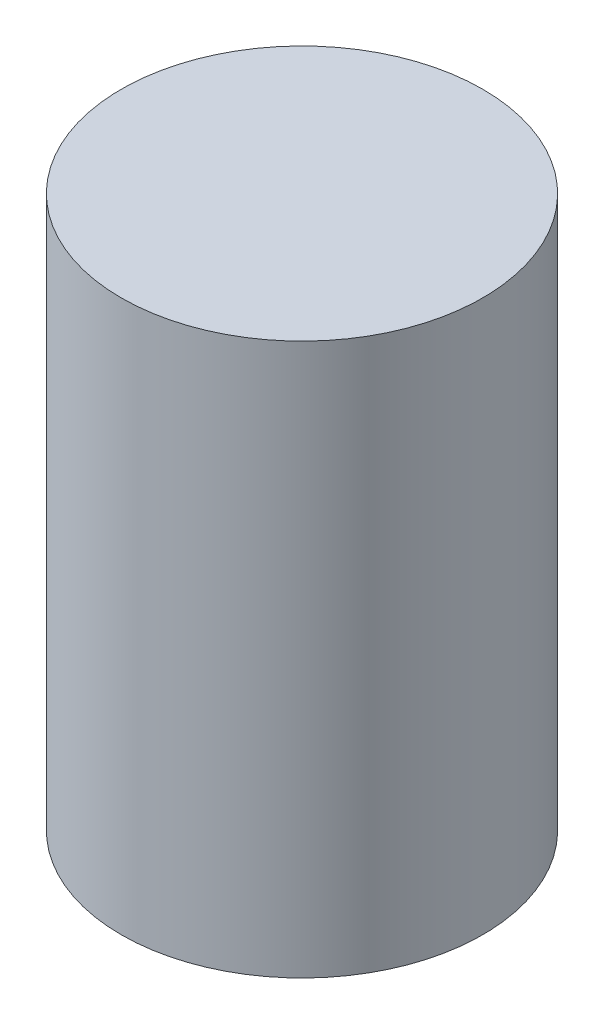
ISO-10303-21;
HEADER;
FILE_DESCRIPTION(('STEP AP214'),'2;1');
FILE_NAME('part.step','',(''),(''),'','','');
FILE_SCHEMA(('AUTOMOTIVE_DESIGN { 1 0 10303 214 1 1 1 1 }'));
ENDSEC;
DATA;
#1=APPLICATION_CONTEXT('core data for automotive mechanical design processes');
#2=APPLICATION_PROTOCOL_DEFINITION('international standard','automotive_design',2000,#1);
#3=PRODUCT_CONTEXT('',#1,'mechanical');
#4=PRODUCT('Part','Part','',(#3));
#5=PRODUCT_RELATED_PRODUCT_CATEGORY('part','',(#4));
#6=PRODUCT_DEFINITION_FORMATION('','',#4);
#7=PRODUCT_DEFINITION_CONTEXT('part definition',#1,'design');
#8=PRODUCT_DEFINITION('design','',#6,#7);
#9=PRODUCT_DEFINITION_SHAPE('','',#8);
#10=(LENGTH_UNIT() NAMED_UNIT(*) SI_UNIT(.MILLI.,.METRE.));
#11=(NAMED_UNIT(*) PLANE_ANGLE_UNIT() SI_UNIT($,.RADIAN.));
#12=(NAMED_UNIT(*) SI_UNIT($,.STERADIAN.) SOLID_ANGLE_UNIT());
#13=UNCERTAINTY_MEASURE_WITH_UNIT(LENGTH_MEASURE(1.E-05),#10,'distance_accuracy_value','');
#14=(GEOMETRIC_REPRESENTATION_CONTEXT(3) GLOBAL_UNCERTAINTY_ASSIGNED_CONTEXT((#13)) GLOBAL_UNIT_ASSIGNED_CONTEXT((#10,
#11,#12)) REPRESENTATION_CONTEXT('',''));
#15=CARTESIAN_POINT('',(0.,0.,0.));
#16=DIRECTION('',(0.,0.,1.));
#17=DIRECTION('',(1.,0.,0.));
#18=AXIS2_PLACEMENT_3D('',#15,#16,#17);
#19=CARTESIAN_POINT('',(0.,67.818,0.));
#20=DIRECTION('',(0.,-1.,0.));
#21=DIRECTION('',(0.,0.,-1.));
#22=AXIS2_PLACEMENT_3D('',#19,#20,#21);
#23=CYLINDRICAL_SURFACE('',#22,22.225);
#24=CARTESIAN_POINT('',(0.,67.818,0.));
#25=DIRECTION('',(0.,1.,0.));
#26=DIRECTION('',(0.,0.,1.));
#27=AXIS2_PLACEMENT_3D('',#24,#25,#26);
#28=CIRCLE('',#27,22.225);
#29=CARTESIAN_POINT('',(0.,67.818,22.225));
#30=VERTEX_POINT('',#29);
#31=EDGE_CURVE('E10',#30,#30,#28,.T.);
#32=ORIENTED_EDGE('',*,*,#31,.F.);
#33=EDGE_LOOP('',(#32));
#34=FACE_BOUND('',#33,.T.);
#35=CARTESIAN_POINT('',(0.,0.,0.));
#36=DIRECTION('',(0.,1.,0.));
#37=DIRECTION('',(0.,0.,1.));
#38=AXIS2_PLACEMENT_3D('',#35,#36,#37);
#39=CIRCLE('',#38,22.225);
#40=CARTESIAN_POINT('',(0.,0.,22.225));
#41=VERTEX_POINT('',#40);
#42=EDGE_CURVE('E38',#41,#41,#39,.T.);
#43=ORIENTED_EDGE('',*,*,#42,.T.);
#44=EDGE_LOOP('',(#43));
#45=FACE_BOUND('',#44,.T.);
#46=ADVANCED_FACE('F35',(#34,#45),#23,.T.);
#47=CARTESIAN_POINT('',(0.,67.818,0.));
#48=DIRECTION('',(0.,1.,0.));
#49=DIRECTION('',(0.,0.,1.));
#50=AXIS2_PLACEMENT_3D('',#47,#48,#49);
#51=PLANE('',#50);
#52=ORIENTED_EDGE('',*,*,#31,.T.);
#53=EDGE_LOOP('',(#52));
#54=FACE_BOUND('',#53,.T.);
#55=ADVANCED_FACE('F50',(#54),#51,.T.);
#56=CARTESIAN_POINT('',(0.,0.,0.));
#57=DIRECTION('',(0.,1.,0.));
#58=DIRECTION('',(0.,0.,1.));
#59=AXIS2_PLACEMENT_3D('',#56,#57,#58);
#60=PLANE('',#59);
#61=ORIENTED_EDGE('',*,*,#42,.F.);
#62=EDGE_LOOP('',(#61));
#63=FACE_BOUND('',#62,.T.);
#64=ADVANCED_FACE('F48',(#63),#60,.F.);
#65=CLOSED_SHELL('',(#46,#55,#64));
#66=MANIFOLD_SOLID_BREP('B2',#65);
#67=ADVANCED_BREP_SHAPE_REPRESENTATION('',(#18,#66),#14);
#68=SHAPE_DEFINITION_REPRESENTATION(#9,#67);
ENDSEC;
END-ISO-10303-21;
